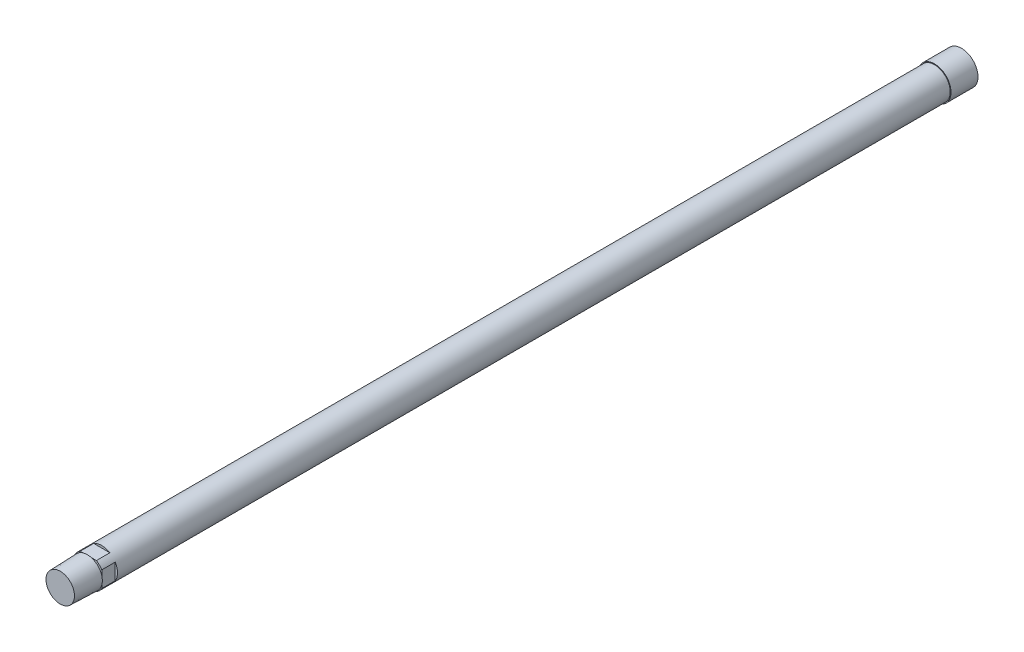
ISO-10303-21;
HEADER;
FILE_DESCRIPTION(('STEP AP214'),'2;1');
FILE_NAME('part.step','',(''),(''),'','','');
FILE_SCHEMA(('AUTOMOTIVE_DESIGN { 1 0 10303 214 1 1 1 1 }'));
ENDSEC;
DATA;
#1=APPLICATION_CONTEXT('core data for automotive mechanical design processes');
#2=APPLICATION_PROTOCOL_DEFINITION('international standard','automotive_design',2000,#1);
#3=PRODUCT_CONTEXT('',#1,'mechanical');
#4=PRODUCT('Part','Part','',(#3));
#5=PRODUCT_RELATED_PRODUCT_CATEGORY('part','',(#4));
#6=PRODUCT_DEFINITION_FORMATION('','',#4);
#7=PRODUCT_DEFINITION_CONTEXT('part definition',#1,'design');
#8=PRODUCT_DEFINITION('design','',#6,#7);
#9=PRODUCT_DEFINITION_SHAPE('','',#8);
#10=(LENGTH_UNIT() NAMED_UNIT(*) SI_UNIT(.MILLI.,.METRE.));
#11=(NAMED_UNIT(*) PLANE_ANGLE_UNIT() SI_UNIT($,.RADIAN.));
#12=(NAMED_UNIT(*) SI_UNIT($,.STERADIAN.) SOLID_ANGLE_UNIT());
#13=UNCERTAINTY_MEASURE_WITH_UNIT(LENGTH_MEASURE(1.E-05),#10,'distance_accuracy_value','');
#14=(GEOMETRIC_REPRESENTATION_CONTEXT(3) GLOBAL_UNCERTAINTY_ASSIGNED_CONTEXT((#13)) GLOBAL_UNIT_ASSIGNED_CONTEXT((#10,
#11,#12)) REPRESENTATION_CONTEXT('',''));
#15=CARTESIAN_POINT('',(0.,0.,0.));
#16=DIRECTION('',(0.,0.,1.));
#17=DIRECTION('',(1.,0.,0.));
#18=AXIS2_PLACEMENT_3D('',#15,#16,#17);
#19=CARTESIAN_POINT('',(0.,0.,617.8804));
#20=DIRECTION('',(0.,0.,-1.));
#21=DIRECTION('',(-1.,0.,0.));
#22=AXIS2_PLACEMENT_3D('',#19,#20,#21);
#23=CYLINDRICAL_SURFACE('',#22,11.1125);
#24=CARTESIAN_POINT('',(0.,0.,0.));
#25=DIRECTION('',(0.,0.,-1.));
#26=DIRECTION('',(-1.,0.,0.));
#27=AXIS2_PLACEMENT_3D('',#24,#25,#26);
#28=CIRCLE('',#27,11.1125);
#29=CARTESIAN_POINT('',(-11.1125,0.,0.));
#30=VERTEX_POINT('',#29);
#31=EDGE_CURVE('E205',#30,#30,#28,.T.);
#32=ORIENTED_EDGE('',*,*,#31,.F.);
#33=EDGE_LOOP('',(#32));
#34=FACE_BOUND('',#33,.T.);
#35=DIRECTION('',(0.,0.,-1.));
#36=VECTOR('',#35,1.);
#37=CARTESIAN_POINT('',(-9.525,5.72381264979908,617.8804));
#38=LINE('',#37,#36);
#39=CARTESIAN_POINT('',(-9.525,5.72381264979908,598.043));
#40=VERTEX_POINT('',#39);
#41=CARTESIAN_POINT('',(-9.525,5.72381264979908,588.518));
#42=VERTEX_POINT('',#41);
#43=EDGE_CURVE('E166',#40,#42,#38,.T.);
#44=ORIENTED_EDGE('',*,*,#43,.F.);
#45=CARTESIAN_POINT('',(0.,0.,598.043));
#46=DIRECTION('',(0.,0.,1.));
#47=DIRECTION('',(1.,0.,0.));
#48=AXIS2_PLACEMENT_3D('',#45,#46,#47);
#49=CIRCLE('',#48,11.1125);
#50=CARTESIAN_POINT('',(-5.72381264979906,9.52500000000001,598.043));
#51=VERTEX_POINT('',#50);
#52=EDGE_CURVE('E126',#51,#40,#49,.T.);
#53=ORIENTED_EDGE('',*,*,#52,.F.);
#54=DIRECTION('',(0.,0.,-1.));
#55=VECTOR('',#54,1.);
#56=CARTESIAN_POINT('',(-5.72381264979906,9.52500000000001,617.8804));
#57=LINE('',#56,#55);
#58=CARTESIAN_POINT('',(-5.72381264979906,9.52500000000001,588.518));
#59=VERTEX_POINT('',#58);
#60=EDGE_CURVE('E154',#59,#51,#57,.F.);
#61=ORIENTED_EDGE('',*,*,#60,.F.);
#62=CARTESIAN_POINT('',(0.,0.,588.518));
#63=DIRECTION('',(0.,0.,1.));
#64=DIRECTION('',(1.,0.,0.));
#65=AXIS2_PLACEMENT_3D('',#62,#63,#64);
#66=CIRCLE('',#65,11.1125);
#67=CARTESIAN_POINT('',(5.72381264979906,9.52500000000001,588.518));
#68=VERTEX_POINT('',#67);
#69=EDGE_CURVE('E49',#68,#59,#66,.T.);
#70=ORIENTED_EDGE('',*,*,#69,.F.);
#71=DIRECTION('',(0.,0.,-1.));
#72=VECTOR('',#71,1.);
#73=CARTESIAN_POINT('',(5.72381264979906,9.52500000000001,617.8804));
#74=LINE('',#73,#72);
#75=CARTESIAN_POINT('',(5.72381264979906,9.52500000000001,598.043));
#76=VERTEX_POINT('',#75);
#77=EDGE_CURVE('E155',#76,#68,#74,.T.);
#78=ORIENTED_EDGE('',*,*,#77,.F.);
#79=CARTESIAN_POINT('',(9.525,5.72381264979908,598.043));
#80=VERTEX_POINT('',#79);
#81=EDGE_CURVE('E114',#80,#76,#49,.T.);
#82=ORIENTED_EDGE('',*,*,#81,.F.);
#83=DIRECTION('',(0.,0.,-1.));
#84=VECTOR('',#83,1.);
#85=CARTESIAN_POINT('',(9.525,5.72381264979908,617.8804));
#86=LINE('',#85,#84);
#87=CARTESIAN_POINT('',(9.525,5.72381264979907,588.518));
#88=VERTEX_POINT('',#87);
#89=EDGE_CURVE('E121',#88,#80,#86,.F.);
#90=ORIENTED_EDGE('',*,*,#89,.F.);
#91=CARTESIAN_POINT('',(9.525,-5.72381264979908,588.518));
#92=VERTEX_POINT('',#91);
#93=EDGE_CURVE('E138',#92,#88,#66,.T.);
#94=ORIENTED_EDGE('',*,*,#93,.F.);
#95=DIRECTION('',(0.,0.,-1.));
#96=VECTOR('',#95,1.);
#97=CARTESIAN_POINT('',(9.525,-5.72381264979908,617.8804));
#98=LINE('',#97,#96);
#99=CARTESIAN_POINT('',(9.525,-5.72381264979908,598.043));
#100=VERTEX_POINT('',#99);
#101=EDGE_CURVE('E159',#100,#92,#98,.T.);
#102=ORIENTED_EDGE('',*,*,#101,.F.);
#103=CARTESIAN_POINT('',(5.7238126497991,-9.52499999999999,598.043));
#104=VERTEX_POINT('',#103);
#105=EDGE_CURVE('E127',#104,#100,#49,.T.);
#106=ORIENTED_EDGE('',*,*,#105,.F.);
#107=DIRECTION('',(0.,0.,-1.));
#108=VECTOR('',#107,1.);
#109=CARTESIAN_POINT('',(5.7238126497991,-9.52499999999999,617.8804));
#110=LINE('',#109,#108);
#111=CARTESIAN_POINT('',(5.72381264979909,-9.52499999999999,588.518));
#112=VERTEX_POINT('',#111);
#113=EDGE_CURVE('E56',#112,#104,#110,.F.);
#114=ORIENTED_EDGE('',*,*,#113,.F.);
#115=CARTESIAN_POINT('',(-5.7238126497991,-9.52499999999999,588.518));
#116=VERTEX_POINT('',#115);
#117=EDGE_CURVE('E44',#116,#112,#66,.T.);
#118=ORIENTED_EDGE('',*,*,#117,.F.);
#119=DIRECTION('',(0.,0.,-1.));
#120=VECTOR('',#119,1.);
#121=CARTESIAN_POINT('',(-5.7238126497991,-9.52499999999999,617.8804));
#122=LINE('',#121,#120);
#123=CARTESIAN_POINT('',(-5.7238126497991,-9.52499999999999,598.043));
#124=VERTEX_POINT('',#123);
#125=EDGE_CURVE('E107',#124,#116,#122,.T.);
#126=ORIENTED_EDGE('',*,*,#125,.F.);
#127=CARTESIAN_POINT('',(-9.525,-5.72381264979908,598.043));
#128=VERTEX_POINT('',#127);
#129=EDGE_CURVE('E120',#128,#124,#49,.T.);
#130=ORIENTED_EDGE('',*,*,#129,.F.);
#131=DIRECTION('',(0.,0.,-1.));
#132=VECTOR('',#131,1.);
#133=CARTESIAN_POINT('',(-9.525,-5.72381264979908,617.8804));
#134=LINE('',#133,#132);
#135=CARTESIAN_POINT('',(-9.525,-5.72381264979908,588.518));
#136=VERTEX_POINT('',#135);
#137=EDGE_CURVE('E64',#136,#128,#134,.F.);
#138=ORIENTED_EDGE('',*,*,#137,.F.);
#139=EDGE_CURVE('E11',#42,#136,#66,.T.);
#140=ORIENTED_EDGE('',*,*,#139,.F.);
#141=EDGE_LOOP('',(#44,#53,#61,#70,#78,#82,#90,#94,#102,#106,#114,#118,#126,#130,#138,#140));
#142=FACE_BOUND('',#141,.T.);
#143=ADVANCED_FACE('F41',(#34,#142),#23,.T.);
#144=CARTESIAN_POINT('',(0.,11.1125,598.043));
#145=DIRECTION('',(0.,0.,1.));
#146=DIRECTION('',(1.,0.,0.));
#147=AXIS2_PLACEMENT_3D('',#144,#145,#146);
#148=PLANE('',#147);
#149=CARTESIAN_POINT('',(0.,0.,598.043));
#150=DIRECTION('',(0.,0.,1.));
#151=DIRECTION('',(1.,0.,0.));
#152=AXIS2_PLACEMENT_3D('',#149,#150,#151);
#153=CIRCLE('',#152,9.51918408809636);
#154=CARTESIAN_POINT('',(9.51918408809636,0.,598.043));
#155=VERTEX_POINT('',#154);
#156=EDGE_CURVE('E129',#155,#155,#153,.T.);
#157=ORIENTED_EDGE('',*,*,#156,.F.);
#158=EDGE_LOOP('',(#157));
#159=FACE_BOUND('',#158,.T.);
#160=ORIENTED_EDGE('',*,*,#52,.T.);
#161=DIRECTION('',(0.,-1.,0.));
#162=VECTOR('',#161,1.);
#163=CARTESIAN_POINT('',(-9.525,11.1125,598.043));
#164=LINE('',#163,#162);
#165=EDGE_CURVE('E125',#40,#128,#164,.T.);
#166=ORIENTED_EDGE('',*,*,#165,.T.);
#167=ORIENTED_EDGE('',*,*,#129,.T.);
#168=DIRECTION('',(1.,0.,0.));
#169=VECTOR('',#168,1.);
#170=CARTESIAN_POINT('',(0.,-9.52499999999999,598.043));
#171=LINE('',#170,#169);
#172=EDGE_CURVE('E104',#124,#104,#171,.T.);
#173=ORIENTED_EDGE('',*,*,#172,.T.);
#174=ORIENTED_EDGE('',*,*,#105,.T.);
#175=DIRECTION('',(0.,1.,0.));
#176=VECTOR('',#175,1.);
#177=CARTESIAN_POINT('',(9.525,11.1125,598.043));
#178=LINE('',#177,#176);
#179=EDGE_CURVE('E113',#100,#80,#178,.T.);
#180=ORIENTED_EDGE('',*,*,#179,.T.);
#181=ORIENTED_EDGE('',*,*,#81,.T.);
#182=DIRECTION('',(-1.,0.,0.));
#183=VECTOR('',#182,1.);
#184=CARTESIAN_POINT('',(0.,9.52500000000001,598.043));
#185=LINE('',#184,#183);
#186=EDGE_CURVE('E136',#76,#51,#185,.T.);
#187=ORIENTED_EDGE('',*,*,#186,.T.);
#188=EDGE_LOOP('',(#160,#166,#167,#173,#174,#180,#181,#187));
#189=FACE_BOUND('',#188,.T.);
#190=ADVANCED_FACE('F124',(#159,#189),#148,.T.);
#191=CARTESIAN_POINT('',(0.,0.,598.9447));
#192=DIRECTION('',(0.,0.,1.));
#193=DIRECTION('',(1.,0.,0.));
#194=AXIS2_PLACEMENT_3D('',#191,#192,#193);
#195=CONICAL_SURFACE('',#194,10.9389620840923,1.00496754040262);
#196=ORIENTED_EDGE('',*,*,#156,.T.);
#197=EDGE_LOOP('',(#196));
#198=FACE_BOUND('',#197,.T.);
#199=CARTESIAN_POINT('',(0.,0.,598.7584906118));
#200=DIRECTION('',(0.,0.,-1.));
#201=DIRECTION('',(0.,1.,0.));
#202=AXIS2_PLACEMENT_3D('',#199,#200,#201);
#203=CIRCLE('',#202,10.6457647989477);
#204=CARTESIAN_POINT('',(0.,10.6457647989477,598.7584906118));
#205=VERTEX_POINT('',#204);
#206=EDGE_CURVE('E167',#205,#205,#203,.T.);
#207=ORIENTED_EDGE('',*,*,#206,.T.);
#208=EDGE_LOOP('',(#207));
#209=FACE_BOUND('',#208,.T.);
#210=ADVANCED_FACE('F174',(#198,#209),#195,.T.);
#211=CARTESIAN_POINT('',(0.,0.,617.8804));
#212=DIRECTION('',(0.,0.,-1.));
#213=DIRECTION('',(0.,1.,0.));
#214=AXIS2_PLACEMENT_3D('',#211,#212,#213);
#215=CONICAL_SURFACE('',#214,10.0515159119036,0.0310668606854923);
#216=ORIENTED_EDGE('',*,*,#206,.F.);
#217=EDGE_LOOP('',(#216));
#218=FACE_BOUND('',#217,.T.);
#219=CARTESIAN_POINT('',(0.,0.,617.8804));
#220=DIRECTION('',(0.,0.,1.));
#221=DIRECTION('',(0.,-1.,0.));
#222=AXIS2_PLACEMENT_3D('',#219,#220,#221);
#223=CIRCLE('',#222,10.0515159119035);
#224=CARTESIAN_POINT('',(0.,-10.0515159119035,617.8804));
#225=VERTEX_POINT('',#224);
#226=EDGE_CURVE('E202',#225,#225,#223,.T.);
#227=ORIENTED_EDGE('',*,*,#226,.F.);
#228=EDGE_LOOP('',(#227));
#229=FACE_BOUND('',#228,.T.);
#230=ADVANCED_FACE('F182',(#218,#229),#215,.T.);
#231=CARTESIAN_POINT('',(-9.525,-9.52499999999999,588.518));
#232=DIRECTION('',(0.,-1.,0.));
#233=DIRECTION('',(0.,0.,-1.));
#234=AXIS2_PLACEMENT_3D('',#231,#232,#233);
#235=PLANE('',#234);
#236=ORIENTED_EDGE('',*,*,#125,.T.);
#237=DIRECTION('',(1.,0.,0.));
#238=VECTOR('',#237,1.);
#239=CARTESIAN_POINT('',(-9.525,-9.52499999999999,588.518));
#240=LINE('',#239,#238);
#241=EDGE_CURVE('E207',#116,#112,#240,.T.);
#242=ORIENTED_EDGE('',*,*,#241,.T.);
#243=ORIENTED_EDGE('',*,*,#113,.T.);
#244=ORIENTED_EDGE('',*,*,#172,.F.);
#245=EDGE_LOOP('',(#236,#242,#243,#244));
#246=FACE_BOUND('',#245,.T.);
#247=ADVANCED_FACE('F106',(#246),#235,.T.);
#248=CARTESIAN_POINT('',(0.,0.,588.518));
#249=DIRECTION('',(0.,0.,1.));
#250=DIRECTION('',(1.,0.,0.));
#251=AXIS2_PLACEMENT_3D('',#248,#249,#250);
#252=PLANE('',#251);
#253=ORIENTED_EDGE('',*,*,#117,.T.);
#254=ORIENTED_EDGE('',*,*,#241,.F.);
#255=EDGE_LOOP('',(#253,#254));
#256=FACE_BOUND('',#255,.T.);
#257=ADVANCED_FACE('F224',(#256),#252,.T.);
#258=CARTESIAN_POINT('',(9.525,-9.52499999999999,588.518));
#259=DIRECTION('',(1.,0.,0.));
#260=DIRECTION('',(0.,0.,-1.));
#261=AXIS2_PLACEMENT_3D('',#258,#259,#260);
#262=PLANE('',#261);
#263=ORIENTED_EDGE('',*,*,#101,.T.);
#264=DIRECTION('',(0.,1.,0.));
#265=VECTOR('',#264,1.);
#266=CARTESIAN_POINT('',(9.525,-9.52499999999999,588.518));
#267=LINE('',#266,#265);
#268=EDGE_CURVE('E156',#92,#88,#267,.T.);
#269=ORIENTED_EDGE('',*,*,#268,.T.);
#270=ORIENTED_EDGE('',*,*,#89,.T.);
#271=ORIENTED_EDGE('',*,*,#179,.F.);
#272=EDGE_LOOP('',(#263,#269,#270,#271));
#273=FACE_BOUND('',#272,.T.);
#274=ADVANCED_FACE('F218',(#273),#262,.T.);
#275=ORIENTED_EDGE('',*,*,#93,.T.);
#276=ORIENTED_EDGE('',*,*,#268,.F.);
#277=EDGE_LOOP('',(#275,#276));
#278=FACE_BOUND('',#277,.T.);
#279=ADVANCED_FACE('F221',(#278),#252,.T.);
#280=CARTESIAN_POINT('',(-9.525,9.52500000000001,588.518));
#281=DIRECTION('',(0.,1.,0.));
#282=DIRECTION('',(0.,0.,1.));
#283=AXIS2_PLACEMENT_3D('',#280,#281,#282);
#284=PLANE('',#283);
#285=ORIENTED_EDGE('',*,*,#77,.T.);
#286=DIRECTION('',(-1.,0.,0.));
#287=VECTOR('',#286,1.);
#288=CARTESIAN_POINT('',(-9.525,9.52500000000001,588.518));
#289=LINE('',#288,#287);
#290=EDGE_CURVE('E149',#68,#59,#289,.T.);
#291=ORIENTED_EDGE('',*,*,#290,.T.);
#292=ORIENTED_EDGE('',*,*,#60,.T.);
#293=ORIENTED_EDGE('',*,*,#186,.F.);
#294=EDGE_LOOP('',(#285,#291,#292,#293));
#295=FACE_BOUND('',#294,.T.);
#296=ADVANCED_FACE('F153',(#295),#284,.T.);
#297=ORIENTED_EDGE('',*,*,#69,.T.);
#298=ORIENTED_EDGE('',*,*,#290,.F.);
#299=EDGE_LOOP('',(#297,#298));
#300=FACE_BOUND('',#299,.T.);
#301=ADVANCED_FACE('F148',(#300),#252,.T.);
#302=ORIENTED_EDGE('',*,*,#139,.T.);
#303=DIRECTION('',(0.,-1.,0.));
#304=VECTOR('',#303,1.);
#305=CARTESIAN_POINT('',(-9.525,-9.52499999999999,588.518));
#306=LINE('',#305,#304);
#307=EDGE_CURVE('E204',#42,#136,#306,.T.);
#308=ORIENTED_EDGE('',*,*,#307,.F.);
#309=EDGE_LOOP('',(#302,#308));
#310=FACE_BOUND('',#309,.T.);
#311=ADVANCED_FACE('F198',(#310),#252,.T.);
#312=CARTESIAN_POINT('',(-9.525,-9.52499999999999,588.518));
#313=DIRECTION('',(-1.,0.,0.));
#314=DIRECTION('',(0.,0.,1.));
#315=AXIS2_PLACEMENT_3D('',#312,#313,#314);
#316=PLANE('',#315);
#317=ORIENTED_EDGE('',*,*,#43,.T.);
#318=ORIENTED_EDGE('',*,*,#307,.T.);
#319=ORIENTED_EDGE('',*,*,#137,.T.);
#320=ORIENTED_EDGE('',*,*,#165,.F.);
#321=EDGE_LOOP('',(#317,#318,#319,#320));
#322=FACE_BOUND('',#321,.T.);
#323=ADVANCED_FACE('F189',(#322),#316,.T.);
#324=CARTESIAN_POINT('',(0.,0.,617.8804));
#325=DIRECTION('',(0.,0.,1.));
#326=DIRECTION('',(1.,0.,0.));
#327=AXIS2_PLACEMENT_3D('',#324,#325,#326);
#328=PLANE('',#327);
#329=ORIENTED_EDGE('',*,*,#226,.T.);
#330=EDGE_LOOP('',(#329));
#331=FACE_BOUND('',#330,.T.);
#332=ADVANCED_FACE('F186',(#331),#328,.T.);
#333=CARTESIAN_POINT('',(0.,0.,0.));
#334=DIRECTION('',(0.,0.,-1.));
#335=DIRECTION('',(-1.,0.,0.));
#336=AXIS2_PLACEMENT_3D('',#333,#334,#335);
#337=PLANE('',#336);
#338=CARTESIAN_POINT('',(0.,0.,0.));
#339=DIRECTION('',(0.,0.,-1.));
#340=DIRECTION('',(-1.,0.,0.));
#341=AXIS2_PLACEMENT_3D('',#338,#339,#340);
#342=CIRCLE('',#341,11.684);
#343=CARTESIAN_POINT('',(11.684,0.,0.));
#344=VERTEX_POINT('',#343);
#345=EDGE_CURVE('E410',#344,#344,#342,.T.);
#346=ORIENTED_EDGE('',*,*,#345,.F.);
#347=EDGE_LOOP('',(#346));
#348=FACE_BOUND('',#347,.T.);
#349=ORIENTED_EDGE('',*,*,#31,.T.);
#350=EDGE_LOOP('',(#349));
#351=FACE_BOUND('',#350,.T.);
#352=ADVANCED_FACE('F188',(#348,#351),#337,.F.);
#353=CARTESIAN_POINT('',(0.,0.,-19.05));
#354=DIRECTION('',(0.,0.,1.));
#355=DIRECTION('',(1.,0.,0.));
#356=AXIS2_PLACEMENT_3D('',#353,#354,#355);
#357=CYLINDRICAL_SURFACE('',#356,11.684);
#358=CARTESIAN_POINT('',(0.,0.,-19.05));
#359=DIRECTION('',(0.,0.,-1.));
#360=DIRECTION('',(-1.,0.,0.));
#361=AXIS2_PLACEMENT_3D('',#358,#359,#360);
#362=CIRCLE('',#361,11.684);
#363=CARTESIAN_POINT('',(11.684,0.,-19.05));
#364=VERTEX_POINT('',#363);
#365=EDGE_CURVE('E210',#364,#364,#362,.T.);
#366=CARTESIAN_POINT('',(11.684,0.,-19.05));
#367=CARTESIAN_POINT('',(11.684,0.,-18.8515625));
#368=CARTESIAN_POINT('',(11.684,0.,-18.653125));
#369=CARTESIAN_POINT('',(11.684,0.,-18.25625));
#370=CARTESIAN_POINT('',(11.684,0.,-18.0578125));
#371=CARTESIAN_POINT('',(11.684,0.,-17.6609375));
#372=CARTESIAN_POINT('',(11.684,0.,-17.4625));
#373=CARTESIAN_POINT('',(11.684,0.,-17.065625));
#374=CARTESIAN_POINT('',(11.684,0.,-16.8671875));
#375=CARTESIAN_POINT('',(11.684,0.,-16.4703125));
#376=CARTESIAN_POINT('',(11.684,0.,-16.271875));
#377=CARTESIAN_POINT('',(11.684,0.,-15.875));
#378=CARTESIAN_POINT('',(11.684,0.,-15.6765625));
#379=CARTESIAN_POINT('',(11.684,0.,-15.2796875));
#380=CARTESIAN_POINT('',(11.684,0.,-15.08125));
#381=CARTESIAN_POINT('',(11.684,0.,-14.684375));
#382=CARTESIAN_POINT('',(11.684,0.,-14.4859375));
#383=CARTESIAN_POINT('',(11.684,0.,-14.0890625));
#384=CARTESIAN_POINT('',(11.684,0.,-13.890625));
#385=CARTESIAN_POINT('',(11.684,0.,-13.49375));
#386=CARTESIAN_POINT('',(11.684,0.,-13.2953125));
#387=CARTESIAN_POINT('',(11.684,0.,-12.8984375));
#388=CARTESIAN_POINT('',(11.684,0.,-12.7));
#389=CARTESIAN_POINT('',(11.684,0.,-12.303125));
#390=CARTESIAN_POINT('',(11.684,0.,-12.1046875));
#391=CARTESIAN_POINT('',(11.684,0.,-11.7078125));
#392=CARTESIAN_POINT('',(11.684,0.,-11.509375));
#393=CARTESIAN_POINT('',(11.684,0.,-11.1125));
#394=CARTESIAN_POINT('',(11.684,0.,-10.9140625));
#395=CARTESIAN_POINT('',(11.684,0.,-10.5171875));
#396=CARTESIAN_POINT('',(11.684,0.,-10.31875));
#397=CARTESIAN_POINT('',(11.684,0.,-9.921875));
#398=CARTESIAN_POINT('',(11.684,0.,-9.7234375));
#399=CARTESIAN_POINT('',(11.684,0.,-9.3265625));
#400=CARTESIAN_POINT('',(11.684,0.,-9.128125));
#401=CARTESIAN_POINT('',(11.684,0.,-8.73125));
#402=CARTESIAN_POINT('',(11.684,0.,-8.5328125));
#403=CARTESIAN_POINT('',(11.684,0.,-8.1359375));
#404=CARTESIAN_POINT('',(11.684,0.,-7.9375));
#405=CARTESIAN_POINT('',(11.684,0.,-7.540625));
#406=CARTESIAN_POINT('',(11.684,0.,-7.3421875));
#407=CARTESIAN_POINT('',(11.684,0.,-6.9453125));
#408=CARTESIAN_POINT('',(11.684,0.,-6.746875));
#409=CARTESIAN_POINT('',(11.684,0.,-6.35));
#410=CARTESIAN_POINT('',(11.684,0.,-6.1515625));
#411=CARTESIAN_POINT('',(11.684,0.,-5.7546875));
#412=CARTESIAN_POINT('',(11.684,0.,-5.55625));
#413=CARTESIAN_POINT('',(11.684,0.,-5.159375));
#414=CARTESIAN_POINT('',(11.684,0.,-4.9609375));
#415=CARTESIAN_POINT('',(11.684,0.,-4.5640625));
#416=CARTESIAN_POINT('',(11.684,0.,-4.365625));
#417=CARTESIAN_POINT('',(11.684,0.,-3.96875));
#418=CARTESIAN_POINT('',(11.684,0.,-3.7703125));
#419=CARTESIAN_POINT('',(11.684,0.,-3.3734375));
#420=CARTESIAN_POINT('',(11.684,0.,-3.175));
#421=CARTESIAN_POINT('',(11.684,0.,-2.778125));
#422=CARTESIAN_POINT('',(11.684,0.,-2.5796875));
#423=CARTESIAN_POINT('',(11.684,0.,-2.1828125));
#424=CARTESIAN_POINT('',(11.684,0.,-1.984375));
#425=CARTESIAN_POINT('',(11.684,0.,-1.5875));
#426=CARTESIAN_POINT('',(11.684,0.,-1.3890625));
#427=CARTESIAN_POINT('',(11.684,0.,-0.992187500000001));
#428=CARTESIAN_POINT('',(11.684,0.,-0.793750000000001));
#429=CARTESIAN_POINT('',(11.684,0.,-0.396875));
#430=CARTESIAN_POINT('',(11.684,0.,-0.1984375));
#431=CARTESIAN_POINT('',(11.684,0.,0.));
#432=B_SPLINE_CURVE_WITH_KNOTS('',3,(#366,#367,#368,#369,#370,#371,#372,#373,#374,#375,#376,
#377,#378,#379,#380,#381,#382,#383,#384,#385,#386,#387,#388,#389,#390,#391,#392,#393,#394,#395,
#396,#397,#398,#399,#400,#401,#402,#403,#404,#405,#406,#407,#408,#409,#410,#411,#412,#413,#414,
#415,#416,#417,#418,#419,#420,#421,#422,#423,#424,#425,#426,#427,#428,#429,#430,#431),
.UNSPECIFIED.,.F.,.F.,(4,2,2,2,2,2,2,2,2,2,2,2,2,2,2,2,2,2,2,2,2,2,2,2,2,2,2,2,2,2,2,2,4),(0.,
0.595312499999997,1.190625,1.7859375,2.38125,2.9765625,3.571875,4.1671875,4.7625,5.3578125,
5.953125,6.5484375,7.14375,7.7390625,8.334375,8.9296875,9.525,10.1203125,10.715625,11.3109375,
11.90625,12.5015625,13.096875,13.6921875,14.2875,14.8828125,15.478125,16.0734375,16.66875,
17.2640625,17.859375,18.4546875,19.05),.UNSPECIFIED.);
#433=EDGE_CURVE('BSEAM195',#364,#344,#432,.T.);
#434=ORIENTED_EDGE('',*,*,#365,.F.);
#435=ORIENTED_EDGE('',*,*,#345,.T.);
#436=ORIENTED_EDGE('',*,*,#433,.T.);
#437=ORIENTED_EDGE('',*,*,#433,.F.);
#438=EDGE_LOOP('',(#434,#436,#435,#437));
#439=FACE_BOUND('',#438,.T.);
#440=ADVANCED_FACE('F195',(#439),#357,.T.);
#441=CARTESIAN_POINT('',(0.,0.,-19.05));
#442=DIRECTION('',(0.,0.,-1.));
#443=DIRECTION('',(-1.,0.,0.));
#444=AXIS2_PLACEMENT_3D('',#441,#442,#443);
#445=PLANE('',#444);
#446=ORIENTED_EDGE('',*,*,#365,.T.);
#447=EDGE_LOOP('',(#446));
#448=FACE_BOUND('',#447,.T.);
#449=ADVANCED_FACE('F270',(#448),#445,.T.);
#450=CLOSED_SHELL('',(#143,#190,#210,#230,#247,#257,#274,#279,#296,#301,#311,#323,#332,#352,
#440,#449));
#451=MANIFOLD_SOLID_BREP('B2',#450);
#452=ADVANCED_BREP_SHAPE_REPRESENTATION('',(#18,#451),#14);
#453=SHAPE_DEFINITION_REPRESENTATION(#9,#452);
ENDSEC;
END-ISO-10303-21;
